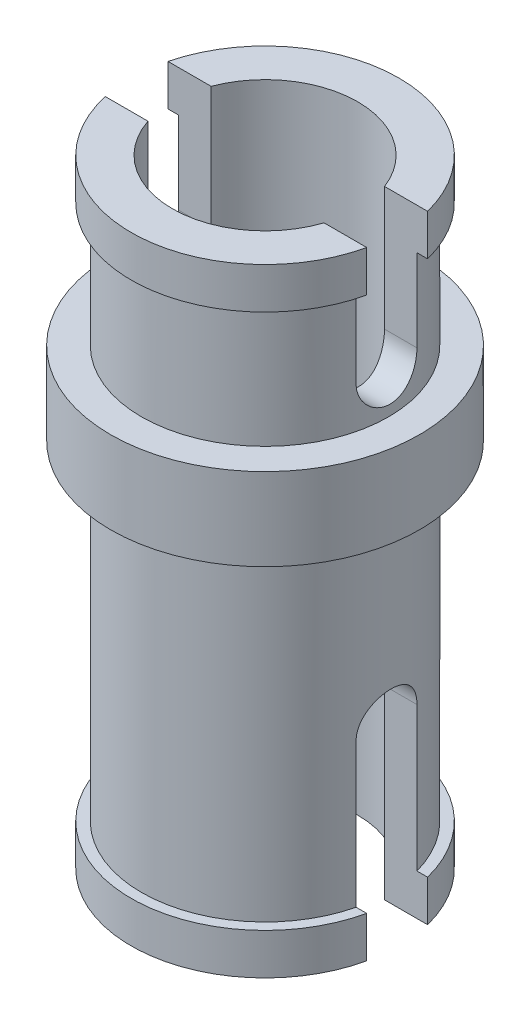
ISO-10303-21;
HEADER;
FILE_DESCRIPTION(('STEP AP214'),'2;1');
FILE_NAME('part.step','',(''),(''),'','','');
FILE_SCHEMA(('AUTOMOTIVE_DESIGN { 1 0 10303 214 1 1 1 1 }'));
ENDSEC;
DATA;
#1=APPLICATION_CONTEXT('core data for automotive mechanical design processes');
#2=APPLICATION_PROTOCOL_DEFINITION('international standard','automotive_design',2000,#1);
#3=PRODUCT_CONTEXT('',#1,'mechanical');
#4=PRODUCT('Part','Part','',(#3));
#5=PRODUCT_RELATED_PRODUCT_CATEGORY('part','',(#4));
#6=PRODUCT_DEFINITION_FORMATION('','',#4);
#7=PRODUCT_DEFINITION_CONTEXT('part definition',#1,'design');
#8=PRODUCT_DEFINITION('design','',#6,#7);
#9=PRODUCT_DEFINITION_SHAPE('','',#8);
#10=(LENGTH_UNIT() NAMED_UNIT(*) SI_UNIT(.MILLI.,.METRE.));
#11=(NAMED_UNIT(*) PLANE_ANGLE_UNIT() SI_UNIT($,.RADIAN.));
#12=(NAMED_UNIT(*) SI_UNIT($,.STERADIAN.) SOLID_ANGLE_UNIT());
#13=UNCERTAINTY_MEASURE_WITH_UNIT(LENGTH_MEASURE(1.E-05),#10,'distance_accuracy_value','');
#14=(GEOMETRIC_REPRESENTATION_CONTEXT(3) GLOBAL_UNCERTAINTY_ASSIGNED_CONTEXT((#13)) GLOBAL_UNIT_ASSIGNED_CONTEXT((#10,
#11,#12)) REPRESENTATION_CONTEXT('',''));
#15=CARTESIAN_POINT('',(0.,0.,0.));
#16=DIRECTION('',(0.,0.,1.));
#17=DIRECTION('',(1.,0.,0.));
#18=AXIS2_PLACEMENT_3D('',#15,#16,#17);
#19=CARTESIAN_POINT('',(0.,3.2,0.));
#20=DIRECTION('',(0.,1.,0.));
#21=DIRECTION('',(0.,0.,1.));
#22=AXIS2_PLACEMENT_3D('',#19,#20,#21);
#23=CYLINDRICAL_SURFACE('',#22,2.6);
#24=DIRECTION('',(0.,1.,0.));
#25=VECTOR('',#24,1.);
#26=CARTESIAN_POINT('',(2.53809081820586,3.2,0.563999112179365));
#27=LINE('',#26,#25);
#28=CARTESIAN_POINT('',(2.53809081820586,4.,0.563999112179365));
#29=VERTEX_POINT('',#28);
#30=CARTESIAN_POINT('',(2.53809081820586,3.2,0.563999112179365));
#31=VERTEX_POINT('',#30);
#32=EDGE_CURVE('E489',#29,#31,#27,.F.);
#33=ORIENTED_EDGE('',*,*,#32,.F.);
#34=CARTESIAN_POINT('',(0.,4.,0.));
#35=DIRECTION('',(0.,1.,0.));
#36=DIRECTION('',(0.,0.,1.));
#37=AXIS2_PLACEMENT_3D('',#34,#35,#36);
#38=CIRCLE('',#37,2.6);
#39=CARTESIAN_POINT('',(-2.53809081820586,4.,0.563999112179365));
#40=VERTEX_POINT('',#39);
#41=EDGE_CURVE('E349',#40,#29,#38,.T.);
#42=ORIENTED_EDGE('',*,*,#41,.F.);
#43=DIRECTION('',(0.,1.,0.));
#44=VECTOR('',#43,1.);
#45=CARTESIAN_POINT('',(-2.53809081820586,3.2,0.563999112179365));
#46=LINE('',#45,#44);
#47=CARTESIAN_POINT('',(-2.53809081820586,3.2,0.563999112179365));
#48=VERTEX_POINT('',#47);
#49=EDGE_CURVE('E505',#48,#40,#46,.T.);
#50=ORIENTED_EDGE('',*,*,#49,.F.);
#51=CARTESIAN_POINT('',(0.,3.2,0.));
#52=DIRECTION('',(0.,1.,0.));
#53=DIRECTION('',(0.,0.,1.));
#54=AXIS2_PLACEMENT_3D('',#51,#52,#53);
#55=CIRCLE('',#54,2.6);
#56=EDGE_CURVE('E348',#48,#31,#55,.T.);
#57=ORIENTED_EDGE('',*,*,#56,.T.);
#58=EDGE_LOOP('',(#33,#42,#50,#57));
#59=FACE_BOUND('',#58,.T.);
#60=ADVANCED_FACE('F36',(#59),#23,.T.);
#61=CARTESIAN_POINT('',(0.,3.2,0.));
#62=DIRECTION('',(0.,1.,0.));
#63=DIRECTION('',(0.,0.,1.));
#64=AXIS2_PLACEMENT_3D('',#61,#62,#63);
#65=PLANE('',#64);
#66=ORIENTED_EDGE('',*,*,#56,.F.);
#67=DIRECTION('',(1.,0.,0.));
#68=VECTOR('',#67,1.);
#69=CARTESIAN_POINT('',(0.,3.2,0.563999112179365));
#70=LINE('',#69,#68);
#71=CARTESIAN_POINT('',(-2.33278910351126,3.2,0.563999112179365));
#72=VERTEX_POINT('',#71);
#73=EDGE_CURVE('E230',#48,#72,#70,.T.);
#74=ORIENTED_EDGE('',*,*,#73,.T.);
#75=CARTESIAN_POINT('',(0.,3.2,0.));
#76=DIRECTION('',(0.,1.,0.));
#77=DIRECTION('',(0.,0.,1.));
#78=AXIS2_PLACEMENT_3D('',#75,#76,#77);
#79=CIRCLE('',#78,2.4);
#80=CARTESIAN_POINT('',(2.33278910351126,3.2,0.563999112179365));
#81=VERTEX_POINT('',#80);
#82=EDGE_CURVE('E477',#72,#81,#79,.T.);
#83=ORIENTED_EDGE('',*,*,#82,.T.);
#84=EDGE_CURVE('E500',#81,#31,#70,.T.);
#85=ORIENTED_EDGE('',*,*,#84,.T.);
#86=EDGE_LOOP('',(#66,#74,#83,#85));
#87=FACE_BOUND('',#86,.T.);
#88=ADVANCED_FACE('F312',(#87),#65,.F.);
#89=CARTESIAN_POINT('',(0.,4.,0.));
#90=DIRECTION('',(0.,1.,0.));
#91=DIRECTION('',(0.,0.,1.));
#92=AXIS2_PLACEMENT_3D('',#89,#90,#91);
#93=PLANE('',#92);
#94=DIRECTION('',(1.,0.,0.));
#95=VECTOR('',#94,1.);
#96=CARTESIAN_POINT('',(0.,4.,0.563999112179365));
#97=LINE('',#96,#95);
#98=CARTESIAN_POINT('',(-1.70935806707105,4.,0.563999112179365));
#99=VERTEX_POINT('',#98);
#100=EDGE_CURVE('E266',#40,#99,#97,.T.);
#101=ORIENTED_EDGE('',*,*,#100,.F.);
#102=ORIENTED_EDGE('',*,*,#41,.T.);
#103=CARTESIAN_POINT('',(1.70935806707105,4.,0.563999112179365));
#104=VERTEX_POINT('',#103);
#105=EDGE_CURVE('E267',#104,#29,#97,.T.);
#106=ORIENTED_EDGE('',*,*,#105,.F.);
#107=CARTESIAN_POINT('',(0.,4.,0.));
#108=DIRECTION('',(0.,1.,0.));
#109=DIRECTION('',(0.,0.,1.));
#110=AXIS2_PLACEMENT_3D('',#107,#108,#109);
#111=CIRCLE('',#110,1.8);
#112=EDGE_CURVE('E228',#99,#104,#111,.T.);
#113=ORIENTED_EDGE('',*,*,#112,.F.);
#114=EDGE_LOOP('',(#101,#102,#106,#113));
#115=FACE_BOUND('',#114,.T.);
#116=ADVANCED_FACE('F318',(#115),#93,.T.);
#117=CARTESIAN_POINT('',(0.,4.,0.));
#118=DIRECTION('',(0.,-1.,0.));
#119=DIRECTION('',(0.,0.,-1.));
#120=AXIS2_PLACEMENT_3D('',#117,#118,#119);
#121=CYLINDRICAL_SURFACE('',#120,2.4);
#122=CARTESIAN_POINT('',(0.,0.8,0.));
#123=DIRECTION('',(0.,1.,0.));
#124=DIRECTION('',(0.,0.,1.));
#125=AXIS2_PLACEMENT_3D('',#122,#123,#124);
#126=CIRCLE('',#125,2.4);
#127=CARTESIAN_POINT('',(0.,0.8,2.4));
#128=VERTEX_POINT('',#127);
#129=EDGE_CURVE('E356',#128,#128,#126,.T.);
#130=ORIENTED_EDGE('',*,*,#129,.T.);
#131=EDGE_LOOP('',(#130));
#132=FACE_BOUND('',#131,.T.);
#133=CARTESIAN_POINT('',(2.31419594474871,1.6,-0.636000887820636));
#134=CARTESIAN_POINT('',(2.31416705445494,1.56688854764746,-0.636032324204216));
#135=CARTESIAN_POINT('',(2.31494846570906,1.53379907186,-0.633262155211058));
#136=CARTESIAN_POINT('',(2.31791197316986,1.46864897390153,-0.622366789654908));
#137=CARTESIAN_POINT('',(2.32009102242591,1.43658627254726,-0.614253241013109));
#138=CARTESIAN_POINT('',(2.32563122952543,1.37432752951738,-0.59291897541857));
#139=CARTESIAN_POINT('',(2.32899220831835,1.34413120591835,-0.579699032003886));
#140=CARTESIAN_POINT('',(2.3365233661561,1.28637395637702,-0.548558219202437));
#141=CARTESIAN_POINT('',(2.34069379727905,1.25881385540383,-0.530635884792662));
#142=CARTESIAN_POINT('',(2.34951148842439,1.20645048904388,-0.490135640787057));
#143=CARTESIAN_POINT('',(2.35416719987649,1.18172093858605,-0.46746425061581));
#144=CARTESIAN_POINT('',(2.36339577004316,1.13636577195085,-0.418312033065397));
#145=CARTESIAN_POINT('',(2.36796861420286,1.11574087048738,-0.391830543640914));
#146=CARTESIAN_POINT('',(2.37664547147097,1.07883383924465,-0.335243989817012));
#147=CARTESIAN_POINT('',(2.38073987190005,1.06263408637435,-0.305083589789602));
#148=CARTESIAN_POINT('',(2.38794093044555,1.03556525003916,-0.242349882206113));
#149=CARTESIAN_POINT('',(2.39104777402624,1.0246951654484,-0.209777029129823));
#150=CARTESIAN_POINT('',(2.39591106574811,1.00881058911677,-0.143812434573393));
#151=CARTESIAN_POINT('',(2.39769273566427,1.00368573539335,-0.110449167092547));
#152=CARTESIAN_POINT('',(2.39984451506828,0.999101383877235,-0.0432919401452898));
#153=CARTESIAN_POINT('',(2.40021482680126,0.999641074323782,-0.00949804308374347));
#154=CARTESIAN_POINT('',(2.39955343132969,1.0062910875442,0.0566712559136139));
#155=CARTESIAN_POINT('',(2.39855627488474,1.01226289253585,0.0890610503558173));
#156=CARTESIAN_POINT('',(2.39536789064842,1.02939472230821,0.152374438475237));
#157=CARTESIAN_POINT('',(2.39317663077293,1.04055488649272,0.183297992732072));
#158=CARTESIAN_POINT('',(2.38785428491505,1.06780338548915,0.243015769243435));
#159=CARTESIAN_POINT('',(2.384717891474,1.08391956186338,0.271796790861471));
#160=CARTESIAN_POINT('',(2.37787482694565,1.12060156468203,0.326292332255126));
#161=CARTESIAN_POINT('',(2.37416807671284,1.14116800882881,0.352006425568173));
#162=CARTESIAN_POINT('',(2.36650518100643,1.18678891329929,0.400334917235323));
#163=CARTESIAN_POINT('',(2.36254507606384,1.21194503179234,0.422852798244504));
#164=CARTESIAN_POINT('',(2.35493151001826,1.26571161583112,0.463383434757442));
#165=CARTESIAN_POINT('',(2.35127813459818,1.29432304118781,0.481394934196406));
#166=CARTESIAN_POINT('',(2.34469483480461,1.35444857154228,0.51250541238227));
#167=CARTESIAN_POINT('',(2.34177041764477,1.3859824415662,0.525567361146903));
#168=CARTESIAN_POINT('',(2.337053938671,1.45086419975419,0.546161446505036));
#169=CARTESIAN_POINT('',(2.3352602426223,1.48420939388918,0.553701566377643));
#170=CARTESIAN_POINT('',(2.33369548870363,1.53153564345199,0.560239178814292));
#171=CARTESIAN_POINT('',(2.33335616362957,1.54519974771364,0.561649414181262));
#172=CARTESIAN_POINT('',(2.33290305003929,1.57257374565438,0.563528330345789));
#173=CARTESIAN_POINT('',(2.332788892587,1.58628352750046,0.563998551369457));
#174=CARTESIAN_POINT('',(2.33278910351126,1.6,0.563999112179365));
#175=B_SPLINE_CURVE_WITH_KNOTS('',3,(#133,#134,#135,#136,#137,#138,#139,#140,#141,#142,#143,
#144,#145,#146,#147,#148,#149,#150,#151,#152,#153,#154,#155,#156,#157,#158,#159,#160,#161,#162,
#163,#164,#165,#166,#167,#168,#169,#170,#171,#172,#173,#174),.UNSPECIFIED.,.F.,.F.,(4,2,2,2,2,2,
2,2,2,2,2,2,2,2,2,2,2,2,2,2,4),(0.,0.0991756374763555,0.198135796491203,0.297080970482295,
0.396057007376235,0.497203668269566,0.59836792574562,0.70130379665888,0.804220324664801,
0.905124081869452,1.00601337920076,1.10440000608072,1.20278927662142,1.30174169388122,
1.40070785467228,1.50221456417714,1.60374953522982,1.70602980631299,1.80816191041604,
1.84935705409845,1.89048464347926),.UNSPECIFIED.);
#176=CARTESIAN_POINT('',(2.3141959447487,1.6,-0.636000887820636));
#177=VERTEX_POINT('',#176);
#178=CARTESIAN_POINT('',(2.33278910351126,1.6,0.563999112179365));
#179=VERTEX_POINT('',#178);
#180=EDGE_CURVE('E226',#177,#179,#175,.T.);
#181=ORIENTED_EDGE('',*,*,#180,.T.);
#182=DIRECTION('',(0.,-1.,0.));
#183=VECTOR('',#182,1.);
#184=CARTESIAN_POINT('',(2.33278910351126,4.,0.563999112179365));
#185=LINE('',#184,#183);
#186=EDGE_CURVE('E503',#179,#81,#185,.F.);
#187=ORIENTED_EDGE('',*,*,#186,.T.);
#188=ORIENTED_EDGE('',*,*,#82,.F.);
#189=DIRECTION('',(0.,-1.,0.));
#190=VECTOR('',#189,1.);
#191=CARTESIAN_POINT('',(-2.33278910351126,4.,0.563999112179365));
#192=LINE('',#191,#190);
#193=CARTESIAN_POINT('',(-2.33278910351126,1.6,0.563999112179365));
#194=VERTEX_POINT('',#193);
#195=EDGE_CURVE('E225',#72,#194,#192,.T.);
#196=ORIENTED_EDGE('',*,*,#195,.T.);
#197=CARTESIAN_POINT('',(-2.33278910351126,1.6,0.563999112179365));
#198=CARTESIAN_POINT('',(-2.33276139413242,1.56672987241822,0.56402987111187));
#199=CARTESIAN_POINT('',(-2.33345744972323,1.53347938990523,0.561233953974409));
#200=CARTESIAN_POINT('',(-2.33608745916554,1.4679988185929,0.550229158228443));
#201=CARTESIAN_POINT('',(-2.33801906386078,1.43576691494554,0.542030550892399));
#202=CARTESIAN_POINT('',(-2.34291191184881,1.37317273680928,0.520459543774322));
#203=CARTESIAN_POINT('',(-2.34587311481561,1.34281038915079,0.507087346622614));
#204=CARTESIAN_POINT('',(-2.35246488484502,1.28474815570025,0.475572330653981));
#205=CARTESIAN_POINT('',(-2.35609560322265,1.25704887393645,0.457428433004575));
#206=CARTESIAN_POINT('',(-2.36367594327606,1.20456762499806,0.416503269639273));
#207=CARTESIAN_POINT('',(-2.36763004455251,1.17984541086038,0.393646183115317));
#208=CARTESIAN_POINT('',(-2.37533585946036,1.13454589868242,0.344103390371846));
#209=CARTESIAN_POINT('',(-2.379087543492,1.11396920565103,0.317417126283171));
#210=CARTESIAN_POINT('',(-2.38598095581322,1.07734115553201,0.260615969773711));
#211=CARTESIAN_POINT('',(-2.38911577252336,1.0613402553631,0.230467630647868));
#212=CARTESIAN_POINT('',(-2.39433139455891,1.03465445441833,0.167820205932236));
#213=CARTESIAN_POINT('',(-2.3964124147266,1.0239684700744,0.135321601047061));
#214=CARTESIAN_POINT('',(-2.39921078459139,1.00842450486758,0.0696140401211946));
#215=CARTESIAN_POINT('',(-2.39995547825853,1.00345043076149,0.0364337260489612));
#216=CARTESIAN_POINT('',(-2.40004059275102,0.99909659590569,-0.0302921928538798));
#217=CARTESIAN_POINT('',(-2.3993811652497,0.999716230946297,-0.0638377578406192));
#218=CARTESIAN_POINT('',(-2.39671750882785,1.0064490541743,-0.129650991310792));
#219=CARTESIAN_POINT('',(-2.39473976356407,1.0124548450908,-0.161930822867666));
#220=CARTESIAN_POINT('',(-2.38963964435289,1.02960683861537,-0.224997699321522));
#221=CARTESIAN_POINT('',(-2.38651720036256,1.04075335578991,-0.255784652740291));
#222=CARTESIAN_POINT('',(-2.379374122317,1.06801247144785,-0.315424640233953));
#223=CARTESIAN_POINT('',(-2.37534288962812,1.08418459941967,-0.344249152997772));
#224=CARTESIAN_POINT('',(-2.36679352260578,1.12099020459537,-0.398813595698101));
#225=CARTESIAN_POINT('',(-2.36227530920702,1.1416244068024,-0.424553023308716));
#226=CARTESIAN_POINT('',(-2.35306501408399,1.18745743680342,-0.472980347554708));
#227=CARTESIAN_POINT('',(-2.34837161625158,1.21276832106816,-0.495562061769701));
#228=CARTESIAN_POINT('',(-2.33943193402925,1.26688952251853,-0.536183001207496));
#229=CARTESIAN_POINT('',(-2.33518576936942,1.29570077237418,-0.554221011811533));
#230=CARTESIAN_POINT('',(-2.32759951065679,1.35614535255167,-0.58526722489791));
#231=CARTESIAN_POINT('',(-2.32426236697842,1.38778743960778,-0.598259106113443));
#232=CARTESIAN_POINT('',(-2.31890963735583,1.45289885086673,-0.618685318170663));
#233=CARTESIAN_POINT('',(-2.31689200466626,1.48636525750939,-0.626128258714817));
#234=CARTESIAN_POINT('',(-2.31517011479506,1.53343496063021,-0.632447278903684));
#235=CARTESIAN_POINT('',(-2.31480532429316,1.5467212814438,-0.633780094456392));
#236=CARTESIAN_POINT('',(-2.31431836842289,1.5733362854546,-0.635555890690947));
#237=CARTESIAN_POINT('',(-2.31419581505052,1.5866648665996,-0.636000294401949));
#238=CARTESIAN_POINT('',(-2.31419594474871,1.6,-0.636000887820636));
#239=B_SPLINE_CURVE_WITH_KNOTS('',3,(#197,#198,#199,#200,#201,#202,#203,#204,#205,#206,#207,
#208,#209,#210,#211,#212,#213,#214,#215,#216,#217,#218,#219,#220,#221,#222,#223,#224,#225,#226,
#227,#228,#229,#230,#231,#232,#233,#234,#235,#236,#237,#238),.UNSPECIFIED.,.F.,.F.,(4,2,2,2,2,2,
2,2,2,2,2,2,2,2,2,2,2,2,2,2,4),(0.,0.0996557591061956,0.199122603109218,0.298585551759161,
0.398071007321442,0.499303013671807,0.600549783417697,0.702873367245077,0.805176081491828,
0.905360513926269,1.00553412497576,1.10375367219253,1.20197923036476,1.30141574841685,
1.40086843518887,1.50311818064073,1.60539523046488,1.70800038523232,1.81044600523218,
1.85049461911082,1.89047903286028),.UNSPECIFIED.);
#240=CARTESIAN_POINT('',(-2.31419594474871,1.6,-0.636000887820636));
#241=VERTEX_POINT('',#240);
#242=EDGE_CURVE('E216',#194,#241,#239,.T.);
#243=ORIENTED_EDGE('',*,*,#242,.T.);
#244=DIRECTION('',(0.,-1.,0.));
#245=VECTOR('',#244,1.);
#246=CARTESIAN_POINT('',(-2.31419594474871,4.,-0.636000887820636));
#247=LINE('',#246,#245);
#248=CARTESIAN_POINT('',(-2.31419594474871,3.2,-0.636000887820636));
#249=VERTEX_POINT('',#248);
#250=EDGE_CURVE('E202',#241,#249,#247,.F.);
#251=ORIENTED_EDGE('',*,*,#250,.T.);
#252=CARTESIAN_POINT('',(2.31419594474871,3.2,-0.636000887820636));
#253=VERTEX_POINT('',#252);
#254=EDGE_CURVE('E482',#253,#249,#79,.T.);
#255=ORIENTED_EDGE('',*,*,#254,.F.);
#256=DIRECTION('',(0.,-1.,0.));
#257=VECTOR('',#256,1.);
#258=CARTESIAN_POINT('',(2.31419594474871,4.,-0.636000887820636));
#259=LINE('',#258,#257);
#260=EDGE_CURVE('E486',#253,#177,#259,.T.);
#261=ORIENTED_EDGE('',*,*,#260,.T.);
#262=EDGE_LOOP('',(#181,#187,#188,#196,#243,#251,#255,#261));
#263=FACE_BOUND('',#262,.T.);
#264=ADVANCED_FACE('F223',(#132,#263),#121,.T.);
#265=CARTESIAN_POINT('',(0.,-8.,0.));
#266=DIRECTION('',(0.,1.,0.));
#267=DIRECTION('',(0.,0.,1.));
#268=AXIS2_PLACEMENT_3D('',#265,#266,#267);
#269=CYLINDRICAL_SURFACE('',#268,2.4);
#270=CARTESIAN_POINT('',(0.,-0.8,0.));
#271=DIRECTION('',(0.,1.,0.));
#272=DIRECTION('',(0.,0.,1.));
#273=AXIS2_PLACEMENT_3D('',#270,#271,#272);
#274=CIRCLE('',#273,2.4);
#275=CARTESIAN_POINT('',(0.,-0.8,2.4));
#276=VERTEX_POINT('',#275);
#277=EDGE_CURVE('E474',#276,#276,#274,.F.);
#278=ORIENTED_EDGE('',*,*,#277,.T.);
#279=EDGE_LOOP('',(#278));
#280=FACE_BOUND('',#279,.T.);
#281=CARTESIAN_POINT('',(2.31419594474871,-4.4,-0.636000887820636));
#282=CARTESIAN_POINT('',(2.31416705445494,-4.36688854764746,-0.636032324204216));
#283=CARTESIAN_POINT('',(2.31494846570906,-4.33379907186,-0.633262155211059));
#284=CARTESIAN_POINT('',(2.31791197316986,-4.26864897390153,-0.622366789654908));
#285=CARTESIAN_POINT('',(2.32009102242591,-4.23658627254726,-0.614253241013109));
#286=CARTESIAN_POINT('',(2.32563122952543,-4.17432752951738,-0.59291897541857));
#287=CARTESIAN_POINT('',(2.32899220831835,-4.14413120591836,-0.579699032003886));
#288=CARTESIAN_POINT('',(2.3365233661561,-4.08637395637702,-0.548558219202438));
#289=CARTESIAN_POINT('',(2.34069379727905,-4.05881385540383,-0.530635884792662));
#290=CARTESIAN_POINT('',(2.34951148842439,-4.00645048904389,-0.490135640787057));
#291=CARTESIAN_POINT('',(2.35416719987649,-3.98172093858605,-0.467464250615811));
#292=CARTESIAN_POINT('',(2.36339577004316,-3.93636577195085,-0.418312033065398));
#293=CARTESIAN_POINT('',(2.36796861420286,-3.91574087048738,-0.391830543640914));
#294=CARTESIAN_POINT('',(2.37664547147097,-3.87883383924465,-0.335243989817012));
#295=CARTESIAN_POINT('',(2.38073987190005,-3.86263408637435,-0.305083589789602));
#296=CARTESIAN_POINT('',(2.38794093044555,-3.83556525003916,-0.242349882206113));
#297=CARTESIAN_POINT('',(2.39104777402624,-3.8246951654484,-0.209777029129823));
#298=CARTESIAN_POINT('',(2.39591106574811,-3.80881058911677,-0.143812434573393));
#299=CARTESIAN_POINT('',(2.39769273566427,-3.80368573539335,-0.110449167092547));
#300=CARTESIAN_POINT('',(2.39984451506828,-3.79910138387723,-0.0432919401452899));
#301=CARTESIAN_POINT('',(2.40021482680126,-3.79964107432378,-0.00949804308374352));
#302=CARTESIAN_POINT('',(2.39955343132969,-3.8062910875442,0.0566712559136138));
#303=CARTESIAN_POINT('',(2.39855627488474,-3.81226289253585,0.0890610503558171));
#304=CARTESIAN_POINT('',(2.39536789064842,-3.82939472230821,0.152374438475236));
#305=CARTESIAN_POINT('',(2.39317663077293,-3.84055488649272,0.183297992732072));
#306=CARTESIAN_POINT('',(2.38785428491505,-3.86780338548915,0.243015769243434));
#307=CARTESIAN_POINT('',(2.384717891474,-3.88391956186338,0.271796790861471));
#308=CARTESIAN_POINT('',(2.37787482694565,-3.92060156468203,0.326292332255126));
#309=CARTESIAN_POINT('',(2.37416807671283,-3.94116800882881,0.352006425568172));
#310=CARTESIAN_POINT('',(2.36650518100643,-3.98678891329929,0.400334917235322));
#311=CARTESIAN_POINT('',(2.36254507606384,-4.01194503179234,0.422852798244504));
#312=CARTESIAN_POINT('',(2.35493151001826,-4.06571161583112,0.463383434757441));
#313=CARTESIAN_POINT('',(2.35127813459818,-4.09432304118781,0.481394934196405));
#314=CARTESIAN_POINT('',(2.34469483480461,-4.15444857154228,0.51250541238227));
#315=CARTESIAN_POINT('',(2.34177041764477,-4.1859824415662,0.525567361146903));
#316=CARTESIAN_POINT('',(2.337053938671,-4.25086419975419,0.546161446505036));
#317=CARTESIAN_POINT('',(2.3352602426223,-4.28420939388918,0.553701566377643));
#318=CARTESIAN_POINT('',(2.33369548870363,-4.33153564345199,0.560239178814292));
#319=CARTESIAN_POINT('',(2.33335616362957,-4.34519974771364,0.561649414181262));
#320=CARTESIAN_POINT('',(2.33290305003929,-4.37257374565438,0.563528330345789));
#321=CARTESIAN_POINT('',(2.332788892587,-4.38628352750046,0.563998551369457));
#322=CARTESIAN_POINT('',(2.33278910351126,-4.4,0.563999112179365));
#323=B_SPLINE_CURVE_WITH_KNOTS('',3,(#281,#282,#283,#284,#285,#286,#287,#288,#289,#290,#291,
#292,#293,#294,#295,#296,#297,#298,#299,#300,#301,#302,#303,#304,#305,#306,#307,#308,#309,#310,
#311,#312,#313,#314,#315,#316,#317,#318,#319,#320,#321,#322),.UNSPECIFIED.,.F.,.F.,(4,2,2,2,2,2,
2,2,2,2,2,2,2,2,2,2,2,2,2,2,4),(0.,0.0991756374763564,0.198135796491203,0.297080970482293,
0.396057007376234,0.497203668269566,0.59836792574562,0.701303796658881,0.804220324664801,
0.905124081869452,1.00601337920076,1.10440000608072,1.20278927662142,1.30174169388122,
1.40070785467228,1.50221456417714,1.60374953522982,1.70602980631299,1.80816191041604,
1.84935705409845,1.89048464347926),.UNSPECIFIED.);
#324=CARTESIAN_POINT('',(2.31419594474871,-4.4,-0.636000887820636));
#325=VERTEX_POINT('',#324);
#326=CARTESIAN_POINT('',(2.33278910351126,-4.4,0.563999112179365));
#327=VERTEX_POINT('',#326);
#328=EDGE_CURVE('E425',#325,#327,#323,.T.);
#329=ORIENTED_EDGE('',*,*,#328,.F.);
#330=DIRECTION('',(0.,1.,0.));
#331=VECTOR('',#330,1.);
#332=CARTESIAN_POINT('',(2.31419594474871,-8.,-0.636000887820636));
#333=LINE('',#332,#331);
#334=CARTESIAN_POINT('',(2.31419594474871,-7.2,-0.636000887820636));
#335=VERTEX_POINT('',#334);
#336=EDGE_CURVE('E432',#335,#325,#333,.T.);
#337=ORIENTED_EDGE('',*,*,#336,.F.);
#338=CARTESIAN_POINT('',(0.,-7.2,0.));
#339=DIRECTION('',(0.,-1.,0.));
#340=DIRECTION('',(0.,0.,-1.));
#341=AXIS2_PLACEMENT_3D('',#338,#339,#340);
#342=CIRCLE('',#341,2.4);
#343=CARTESIAN_POINT('',(-2.31419594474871,-7.2,-0.636000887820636));
#344=VERTEX_POINT('',#343);
#345=EDGE_CURVE('E478',#335,#344,#342,.F.);
#346=ORIENTED_EDGE('',*,*,#345,.T.);
#347=DIRECTION('',(0.,1.,0.));
#348=VECTOR('',#347,1.);
#349=CARTESIAN_POINT('',(-2.31419594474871,-8.,-0.636000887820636));
#350=LINE('',#349,#348);
#351=CARTESIAN_POINT('',(-2.31419594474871,-4.4,-0.636000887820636));
#352=VERTEX_POINT('',#351);
#353=EDGE_CURVE('E406',#344,#352,#350,.T.);
#354=ORIENTED_EDGE('',*,*,#353,.T.);
#355=CARTESIAN_POINT('',(-2.31419594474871,-4.4,-0.636000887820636));
#356=CARTESIAN_POINT('',(-2.31416705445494,-4.36688854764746,-0.636032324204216));
#357=CARTESIAN_POINT('',(-2.31494846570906,-4.33379907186,-0.633262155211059));
#358=CARTESIAN_POINT('',(-2.31791197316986,-4.26864897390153,-0.622366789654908));
#359=CARTESIAN_POINT('',(-2.32009102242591,-4.23658627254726,-0.614253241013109));
#360=CARTESIAN_POINT('',(-2.32563122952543,-4.17432752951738,-0.59291897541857));
#361=CARTESIAN_POINT('',(-2.32899220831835,-4.14413120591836,-0.579699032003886));
#362=CARTESIAN_POINT('',(-2.3365233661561,-4.08637395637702,-0.548558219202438));
#363=CARTESIAN_POINT('',(-2.34069379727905,-4.05881385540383,-0.530635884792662));
#364=CARTESIAN_POINT('',(-2.34951148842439,-4.00645048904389,-0.490135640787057));
#365=CARTESIAN_POINT('',(-2.35416719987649,-3.98172093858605,-0.467464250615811));
#366=CARTESIAN_POINT('',(-2.36339577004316,-3.93636577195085,-0.418312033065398));
#367=CARTESIAN_POINT('',(-2.36796861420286,-3.91574087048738,-0.391830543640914));
#368=CARTESIAN_POINT('',(-2.37664547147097,-3.87883383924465,-0.335243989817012));
#369=CARTESIAN_POINT('',(-2.38073987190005,-3.86263408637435,-0.305083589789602));
#370=CARTESIAN_POINT('',(-2.38794093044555,-3.83556525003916,-0.242349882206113));
#371=CARTESIAN_POINT('',(-2.39104777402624,-3.8246951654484,-0.209777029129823));
#372=CARTESIAN_POINT('',(-2.39591106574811,-3.80881058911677,-0.143812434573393));
#373=CARTESIAN_POINT('',(-2.39769273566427,-3.80368573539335,-0.110449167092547));
#374=CARTESIAN_POINT('',(-2.39984451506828,-3.79910138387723,-0.0432919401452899));
#375=CARTESIAN_POINT('',(-2.40021482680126,-3.79964107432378,-0.00949804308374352));
#376=CARTESIAN_POINT('',(-2.39955343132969,-3.8062910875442,0.0566712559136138));
#377=CARTESIAN_POINT('',(-2.39855627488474,-3.81226289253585,0.0890610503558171));
#378=CARTESIAN_POINT('',(-2.39536789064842,-3.82939472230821,0.152374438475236));
#379=CARTESIAN_POINT('',(-2.39317663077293,-3.84055488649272,0.183297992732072));
#380=CARTESIAN_POINT('',(-2.38785428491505,-3.86780338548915,0.243015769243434));
#381=CARTESIAN_POINT('',(-2.384717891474,-3.88391956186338,0.271796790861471));
#382=CARTESIAN_POINT('',(-2.37787482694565,-3.92060156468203,0.326292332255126));
#383=CARTESIAN_POINT('',(-2.37416807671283,-3.94116800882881,0.352006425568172));
#384=CARTESIAN_POINT('',(-2.36650518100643,-3.98678891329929,0.400334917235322));
#385=CARTESIAN_POINT('',(-2.36254507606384,-4.01194503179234,0.422852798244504));
#386=CARTESIAN_POINT('',(-2.35493151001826,-4.06571161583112,0.463383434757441));
#387=CARTESIAN_POINT('',(-2.35127813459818,-4.09432304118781,0.481394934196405));
#388=CARTESIAN_POINT('',(-2.34469483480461,-4.15444857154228,0.51250541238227));
#389=CARTESIAN_POINT('',(-2.34177041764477,-4.1859824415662,0.525567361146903));
#390=CARTESIAN_POINT('',(-2.337053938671,-4.25086419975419,0.546161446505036));
#391=CARTESIAN_POINT('',(-2.3352602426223,-4.28420939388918,0.553701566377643));
#392=CARTESIAN_POINT('',(-2.33369548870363,-4.33153564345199,0.560239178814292));
#393=CARTESIAN_POINT('',(-2.33335616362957,-4.34519974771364,0.561649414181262));
#394=CARTESIAN_POINT('',(-2.33290305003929,-4.37257374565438,0.563528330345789));
#395=CARTESIAN_POINT('',(-2.332788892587,-4.38628352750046,0.563998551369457));
#396=CARTESIAN_POINT('',(-2.33278910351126,-4.4,0.563999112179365));
#397=B_SPLINE_CURVE_WITH_KNOTS('',3,(#355,#356,#357,#358,#359,#360,#361,#362,#363,#364,#365,
#366,#367,#368,#369,#370,#371,#372,#373,#374,#375,#376,#377,#378,#379,#380,#381,#382,#383,#384,
#385,#386,#387,#388,#389,#390,#391,#392,#393,#394,#395,#396),.UNSPECIFIED.,.F.,.F.,(4,2,2,2,2,2,
2,2,2,2,2,2,2,2,2,2,2,2,2,2,4),(0.,0.0991756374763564,0.198135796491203,0.297080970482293,
0.396057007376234,0.497203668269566,0.59836792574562,0.701303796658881,0.804220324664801,
0.905124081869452,1.00601337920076,1.10440000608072,1.20278927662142,1.30174169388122,
1.40070785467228,1.50221456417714,1.60374953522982,1.70602980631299,1.80816191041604,
1.84935705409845,1.89048464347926),.UNSPECIFIED.);
#398=CARTESIAN_POINT('',(-2.33278910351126,-4.4,0.563999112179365));
#399=VERTEX_POINT('',#398);
#400=EDGE_CURVE('E377',#352,#399,#397,.T.);
#401=ORIENTED_EDGE('',*,*,#400,.T.);
#402=DIRECTION('',(0.,1.,0.));
#403=VECTOR('',#402,1.);
#404=CARTESIAN_POINT('',(-2.33278910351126,-8.,0.563999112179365));
#405=LINE('',#404,#403);
#406=CARTESIAN_POINT('',(-2.33278910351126,-7.2,0.563999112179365));
#407=VERTEX_POINT('',#406);
#408=EDGE_CURVE('E385',#399,#407,#405,.F.);
#409=ORIENTED_EDGE('',*,*,#408,.T.);
#410=CARTESIAN_POINT('',(2.33278910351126,-7.2,0.563999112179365));
#411=VERTEX_POINT('',#410);
#412=EDGE_CURVE('E471',#407,#411,#342,.F.);
#413=ORIENTED_EDGE('',*,*,#412,.T.);
#414=DIRECTION('',(0.,1.,0.));
#415=VECTOR('',#414,1.);
#416=CARTESIAN_POINT('',(2.33278910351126,-8.,0.563999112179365));
#417=LINE('',#416,#415);
#418=EDGE_CURVE('E453',#327,#411,#417,.F.);
#419=ORIENTED_EDGE('',*,*,#418,.F.);
#420=EDGE_LOOP('',(#329,#337,#346,#354,#401,#409,#413,#419));
#421=FACE_BOUND('',#420,.T.);
#422=ADVANCED_FACE('F38',(#280,#421),#269,.T.);
#423=CARTESIAN_POINT('',(0.,-7.2,0.));
#424=DIRECTION('',(0.,-1.,0.));
#425=DIRECTION('',(0.,0.,-1.));
#426=AXIS2_PLACEMENT_3D('',#423,#424,#425);
#427=CYLINDRICAL_SURFACE('',#426,2.6);
#428=CARTESIAN_POINT('',(0.,-7.2,0.));
#429=DIRECTION('',(0.,-1.,0.));
#430=DIRECTION('',(0.,0.,-1.));
#431=AXIS2_PLACEMENT_3D('',#428,#429,#430);
#432=CIRCLE('',#431,2.6);
#433=CARTESIAN_POINT('',(-2.52101227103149,-7.2,-0.636000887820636));
#434=VERTEX_POINT('',#433);
#435=CARTESIAN_POINT('',(2.52101227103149,-7.2,-0.636000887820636));
#436=VERTEX_POINT('',#435);
#437=EDGE_CURVE('E459',#434,#436,#432,.T.);
#438=ORIENTED_EDGE('',*,*,#437,.T.);
#439=DIRECTION('',(0.,-1.,0.));
#440=VECTOR('',#439,1.);
#441=CARTESIAN_POINT('',(2.52101227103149,-7.2,-0.636000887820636));
#442=LINE('',#441,#440);
#443=CARTESIAN_POINT('',(2.52101227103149,-8.,-0.636000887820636));
#444=VERTEX_POINT('',#443);
#445=EDGE_CURVE('E433',#444,#436,#442,.F.);
#446=ORIENTED_EDGE('',*,*,#445,.F.);
#447=CARTESIAN_POINT('',(0.,-8.,0.));
#448=DIRECTION('',(0.,-1.,0.));
#449=DIRECTION('',(0.,0.,-1.));
#450=AXIS2_PLACEMENT_3D('',#447,#448,#449);
#451=CIRCLE('',#450,2.6);
#452=CARTESIAN_POINT('',(-2.52101227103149,-8.,-0.636000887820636));
#453=VERTEX_POINT('',#452);
#454=EDGE_CURVE('E464',#453,#444,#451,.T.);
#455=ORIENTED_EDGE('',*,*,#454,.F.);
#456=DIRECTION('',(0.,-1.,0.));
#457=VECTOR('',#456,1.);
#458=CARTESIAN_POINT('',(-2.52101227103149,-7.2,-0.636000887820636));
#459=LINE('',#458,#457);
#460=EDGE_CURVE('E403',#453,#434,#459,.F.);
#461=ORIENTED_EDGE('',*,*,#460,.T.);
#462=EDGE_LOOP('',(#438,#446,#455,#461));
#463=FACE_BOUND('',#462,.T.);
#464=ADVANCED_FACE('F286',(#463),#427,.T.);
#465=CARTESIAN_POINT('',(2.53809081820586,-8.,0.563999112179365));
#466=VERTEX_POINT('',#465);
#467=CARTESIAN_POINT('',(-2.53809081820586,-8.,0.563999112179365));
#468=VERTEX_POINT('',#467);
#469=EDGE_CURVE('E463',#466,#468,#451,.T.);
#470=ORIENTED_EDGE('',*,*,#469,.F.);
#471=DIRECTION('',(0.,-1.,0.));
#472=VECTOR('',#471,1.);
#473=CARTESIAN_POINT('',(2.53809081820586,-7.2,0.563999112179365));
#474=LINE('',#473,#472);
#475=CARTESIAN_POINT('',(2.53809081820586,-7.2,0.563999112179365));
#476=VERTEX_POINT('',#475);
#477=EDGE_CURVE('E451',#476,#466,#474,.T.);
#478=ORIENTED_EDGE('',*,*,#477,.F.);
#479=CARTESIAN_POINT('',(-2.53809081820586,-7.2,0.563999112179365));
#480=VERTEX_POINT('',#479);
#481=EDGE_CURVE('E462',#476,#480,#432,.T.);
#482=ORIENTED_EDGE('',*,*,#481,.T.);
#483=DIRECTION('',(0.,-1.,0.));
#484=VECTOR('',#483,1.);
#485=CARTESIAN_POINT('',(-2.53809081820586,-7.2,0.563999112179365));
#486=LINE('',#485,#484);
#487=EDGE_CURVE('E386',#480,#468,#486,.T.);
#488=ORIENTED_EDGE('',*,*,#487,.T.);
#489=EDGE_LOOP('',(#470,#478,#482,#488));
#490=FACE_BOUND('',#489,.T.);
#491=ADVANCED_FACE('F284',(#490),#427,.T.);
#492=CARTESIAN_POINT('',(0.,-7.2,0.));
#493=DIRECTION('',(0.,-1.,0.));
#494=DIRECTION('',(0.,0.,-1.));
#495=AXIS2_PLACEMENT_3D('',#492,#493,#494);
#496=PLANE('',#495);
#497=DIRECTION('',(1.,0.,0.));
#498=VECTOR('',#497,1.);
#499=CARTESIAN_POINT('',(3.001,-7.2,-0.636000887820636));
#500=LINE('',#499,#498);
#501=EDGE_CURVE('E775',#335,#436,#500,.T.);
#502=ORIENTED_EDGE('',*,*,#501,.T.);
#503=ORIENTED_EDGE('',*,*,#437,.F.);
#504=DIRECTION('',(-1.,0.,0.));
#505=VECTOR('',#504,1.);
#506=CARTESIAN_POINT('',(-3.001,-7.2,-0.636000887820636));
#507=LINE('',#506,#505);
#508=EDGE_CURVE('E401',#344,#434,#507,.T.);
#509=ORIENTED_EDGE('',*,*,#508,.F.);
#510=ORIENTED_EDGE('',*,*,#345,.F.);
#511=EDGE_LOOP('',(#502,#503,#509,#510));
#512=FACE_BOUND('',#511,.T.);
#513=ADVANCED_FACE('F279',(#512),#496,.F.);
#514=DIRECTION('',(-1.,0.,0.));
#515=VECTOR('',#514,1.);
#516=CARTESIAN_POINT('',(3.001,-7.2,0.563999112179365));
#517=LINE('',#516,#515);
#518=EDGE_CURVE('E448',#476,#411,#517,.T.);
#519=ORIENTED_EDGE('',*,*,#518,.T.);
#520=ORIENTED_EDGE('',*,*,#412,.F.);
#521=DIRECTION('',(1.,0.,0.));
#522=VECTOR('',#521,1.);
#523=CARTESIAN_POINT('',(-3.001,-7.2,0.563999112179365));
#524=LINE('',#523,#522);
#525=EDGE_CURVE('E762',#480,#407,#524,.T.);
#526=ORIENTED_EDGE('',*,*,#525,.F.);
#527=ORIENTED_EDGE('',*,*,#481,.F.);
#528=EDGE_LOOP('',(#519,#520,#526,#527));
#529=FACE_BOUND('',#528,.T.);
#530=ADVANCED_FACE('F283',(#529),#496,.F.);
#531=CARTESIAN_POINT('',(0.,-8.,0.));
#532=DIRECTION('',(0.,1.,0.));
#533=DIRECTION('',(0.,0.,1.));
#534=AXIS2_PLACEMENT_3D('',#531,#532,#533);
#535=PLANE('',#534);
#536=DIRECTION('',(-1.,0.,0.));
#537=VECTOR('',#536,1.);
#538=CARTESIAN_POINT('',(3.001,-8.,-0.636000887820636));
#539=LINE('',#538,#537);
#540=CARTESIAN_POINT('',(1.68389514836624,-8.,-0.636000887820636));
#541=VERTEX_POINT('',#540);
#542=EDGE_CURVE('E443',#444,#541,#539,.T.);
#543=ORIENTED_EDGE('',*,*,#542,.T.);
#544=CARTESIAN_POINT('',(0.,-8.,0.));
#545=DIRECTION('',(0.,1.,0.));
#546=DIRECTION('',(0.,0.,1.));
#547=AXIS2_PLACEMENT_3D('',#544,#545,#546);
#548=CIRCLE('',#547,1.8);
#549=CARTESIAN_POINT('',(-1.68389514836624,-8.,-0.636000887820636));
#550=VERTEX_POINT('',#549);
#551=EDGE_CURVE('E458',#550,#541,#548,.F.);
#552=ORIENTED_EDGE('',*,*,#551,.F.);
#553=DIRECTION('',(1.,0.,0.));
#554=VECTOR('',#553,1.);
#555=CARTESIAN_POINT('',(-3.001,-8.,-0.636000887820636));
#556=LINE('',#555,#554);
#557=EDGE_CURVE('E389',#453,#550,#556,.T.);
#558=ORIENTED_EDGE('',*,*,#557,.F.);
#559=ORIENTED_EDGE('',*,*,#454,.T.);
#560=EDGE_LOOP('',(#543,#552,#558,#559));
#561=FACE_BOUND('',#560,.T.);
#562=ADVANCED_FACE('F301',(#561),#535,.F.);
#563=DIRECTION('',(-1.,0.,0.));
#564=VECTOR('',#563,1.);
#565=CARTESIAN_POINT('',(3.001,-8.,0.563999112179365));
#566=LINE('',#565,#564);
#567=CARTESIAN_POINT('',(1.70935806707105,-8.,0.563999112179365));
#568=VERTEX_POINT('',#567);
#569=EDGE_CURVE('E435',#466,#568,#566,.T.);
#570=ORIENTED_EDGE('',*,*,#569,.F.);
#571=ORIENTED_EDGE('',*,*,#469,.T.);
#572=DIRECTION('',(1.,0.,0.));
#573=VECTOR('',#572,1.);
#574=CARTESIAN_POINT('',(-3.001,-8.,0.563999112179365));
#575=LINE('',#574,#573);
#576=CARTESIAN_POINT('',(-1.70935806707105,-8.,0.563999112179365));
#577=VERTEX_POINT('',#576);
#578=EDGE_CURVE('E390',#468,#577,#575,.T.);
#579=ORIENTED_EDGE('',*,*,#578,.T.);
#580=EDGE_CURVE('E455',#568,#577,#548,.F.);
#581=ORIENTED_EDGE('',*,*,#580,.F.);
#582=EDGE_LOOP('',(#570,#571,#579,#581));
#583=FACE_BOUND('',#582,.T.);
#584=ADVANCED_FACE('F275',(#583),#535,.F.);
#585=CARTESIAN_POINT('',(0.,-8.001,0.));
#586=DIRECTION('',(0.,1.,0.));
#587=DIRECTION('',(0.,0.,1.));
#588=AXIS2_PLACEMENT_3D('',#585,#586,#587);
#589=CYLINDRICAL_SURFACE('',#588,1.8);
#590=DIRECTION('',(0.,1.,0.));
#591=VECTOR('',#590,1.);
#592=CARTESIAN_POINT('',(1.68389514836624,-8.001,-0.636000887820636));
#593=LINE('',#592,#591);
#594=CARTESIAN_POINT('',(1.68389514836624,-4.4,-0.636000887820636));
#595=VERTEX_POINT('',#594);
#596=EDGE_CURVE('E417',#541,#595,#593,.T.);
#597=ORIENTED_EDGE('',*,*,#596,.T.);
#598=CARTESIAN_POINT('',(1.68389514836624,-4.4,-0.636000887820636));
#599=CARTESIAN_POINT('',(1.68385552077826,-4.36739781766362,-0.636034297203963));
#600=CARTESIAN_POINT('',(1.68489783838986,-4.33482871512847,-0.633346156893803));
#601=CARTESIAN_POINT('',(1.68883756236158,-4.27075833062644,-0.622802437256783));
#602=CARTESIAN_POINT('',(1.69172887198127,-4.23925389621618,-0.614963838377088));
#603=CARTESIAN_POINT('',(1.69905907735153,-4.17810905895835,-0.594398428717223));
#604=CARTESIAN_POINT('',(1.70349695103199,-4.14846744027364,-0.58167484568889));
#605=CARTESIAN_POINT('',(1.71342556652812,-4.09171855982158,-0.551744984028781));
#606=CARTESIAN_POINT('',(1.71891703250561,-4.06461306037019,-0.534535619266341));
#607=CARTESIAN_POINT('',(1.73063042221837,-4.0125461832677,-0.495329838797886));
#608=CARTESIAN_POINT('',(1.73687258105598,-3.98771107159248,-0.473171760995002));
#609=CARTESIAN_POINT('',(1.74927182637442,-3.94202156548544,-0.425047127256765));
#610=CARTESIAN_POINT('',(1.75542889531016,-3.92116798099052,-0.399079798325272));
#611=CARTESIAN_POINT('',(1.76724978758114,-3.88336804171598,-0.343035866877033));
#612=CARTESIAN_POINT('',(1.77289079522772,-3.8665723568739,-0.312852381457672));
#613=CARTESIAN_POINT('',(1.78285715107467,-3.83835082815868,-0.249870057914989));
#614=CARTESIAN_POINT('',(1.78718287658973,-3.82692344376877,-0.21707197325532));
#615=CARTESIAN_POINT('',(1.79395741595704,-3.81015903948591,-0.150943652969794));
#616=CARTESIAN_POINT('',(1.79646413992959,-3.80463119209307,-0.117667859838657));
#617=CARTESIAN_POINT('',(1.79960232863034,-3.79923441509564,-0.0505758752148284));
#618=CARTESIAN_POINT('',(1.80023430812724,-3.79936393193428,-0.0167598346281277));
#619=CARTESIAN_POINT('',(1.79962272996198,-3.80516046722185,0.0488743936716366));
#620=CARTESIAN_POINT('',(1.79846017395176,-3.81058449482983,0.0807151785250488));
#621=CARTESIAN_POINT('',(1.79458032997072,-3.82642954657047,0.14302560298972));
#622=CARTESIAN_POINT('',(1.79186299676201,-3.83685071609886,0.17349520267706));
#623=CARTESIAN_POINT('',(1.78517289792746,-3.86244953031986,0.232478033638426));
#624=CARTESIAN_POINT('',(1.78119111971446,-3.87766131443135,0.260975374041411));
#625=CARTESIAN_POINT('',(1.77242050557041,-3.91237990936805,0.315084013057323));
#626=CARTESIAN_POINT('',(1.76763146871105,-3.93188778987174,0.340694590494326));
#627=CARTESIAN_POINT('',(1.75753681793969,-3.97565671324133,0.389503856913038));
#628=CARTESIAN_POINT('',(1.75221771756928,-4.00009005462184,0.412545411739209));
#629=CARTESIAN_POINT('',(1.74186738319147,-4.05249981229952,0.454270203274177));
#630=CARTESIAN_POINT('',(1.73683624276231,-4.08047737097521,0.472952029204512));
#631=CARTESIAN_POINT('',(1.72758322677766,-4.13979332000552,0.505719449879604));
#632=CARTESIAN_POINT('',(1.72337718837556,-4.17118228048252,0.51971817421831));
#633=CARTESIAN_POINT('',(1.71644727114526,-4.23601710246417,0.542170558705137));
#634=CARTESIAN_POINT('',(1.71372120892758,-4.26945985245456,0.550632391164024));
#635=CARTESIAN_POINT('',(1.71107460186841,-4.31935320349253,0.558775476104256));
#636=CARTESIAN_POINT('',(1.71043284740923,-4.33542364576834,0.560733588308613));
#637=CARTESIAN_POINT('',(1.70957421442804,-4.36765989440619,0.563344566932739));
#638=CARTESIAN_POINT('',(1.70935677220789,-4.38382554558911,0.56399916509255));
#639=CARTESIAN_POINT('',(1.70935806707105,-4.4,0.563999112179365));
#640=B_SPLINE_CURVE_WITH_KNOTS('',3,(#598,#599,#600,#601,#602,#603,#604,#605,#606,#607,#608,
#609,#610,#611,#612,#613,#614,#615,#616,#617,#618,#619,#620,#621,#622,#623,#624,#625,#626,#627,
#628,#629,#630,#631,#632,#633,#634,#635,#636,#637,#638,#639),.UNSPECIFIED.,.F.,.F.,(4,2,2,2,2,2,
2,2,2,2,2,2,2,2,2,2,2,2,2,2,4),(0.,0.0976276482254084,0.194935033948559,0.292178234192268,
0.389488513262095,0.490626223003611,0.591784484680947,0.696262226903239,0.800709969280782,
0.901666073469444,1.00259445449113,1.09909853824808,1.19560543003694,1.29281624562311,
1.39005129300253,1.49159441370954,1.593170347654,1.69653768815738,1.7997521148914,
1.84830806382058,1.89679946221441),.UNSPECIFIED.);
#641=CARTESIAN_POINT('',(1.70935806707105,-4.4,0.563999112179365));
#642=VERTEX_POINT('',#641);
#643=EDGE_CURVE('E409',#595,#642,#640,.T.);
#644=ORIENTED_EDGE('',*,*,#643,.T.);
#645=DIRECTION('',(0.,1.,0.));
#646=VECTOR('',#645,1.);
#647=CARTESIAN_POINT('',(1.70935806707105,-8.001,0.563999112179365));
#648=LINE('',#647,#646);
#649=EDGE_CURVE('E445',#642,#568,#648,.F.);
#650=ORIENTED_EDGE('',*,*,#649,.T.);
#651=ORIENTED_EDGE('',*,*,#580,.T.);
#652=DIRECTION('',(0.,1.,0.));
#653=VECTOR('',#652,1.);
#654=CARTESIAN_POINT('',(-1.70935806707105,-8.001,0.563999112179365));
#655=LINE('',#654,#653);
#656=CARTESIAN_POINT('',(-1.70935806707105,-4.4,0.563999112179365));
#657=VERTEX_POINT('',#656);
#658=EDGE_CURVE('E367',#657,#577,#655,.F.);
#659=ORIENTED_EDGE('',*,*,#658,.F.);
#660=CARTESIAN_POINT('',(-1.68389514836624,-4.4,-0.636000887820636));
#661=CARTESIAN_POINT('',(-1.68385552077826,-4.36739781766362,-0.636034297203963));
#662=CARTESIAN_POINT('',(-1.68489783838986,-4.33482871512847,-0.633346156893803));
#663=CARTESIAN_POINT('',(-1.68883756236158,-4.27075833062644,-0.622802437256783));
#664=CARTESIAN_POINT('',(-1.69172887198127,-4.23925389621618,-0.614963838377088));
#665=CARTESIAN_POINT('',(-1.69905907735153,-4.17810905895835,-0.594398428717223));
#666=CARTESIAN_POINT('',(-1.70349695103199,-4.14846744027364,-0.58167484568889));
#667=CARTESIAN_POINT('',(-1.71342556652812,-4.09171855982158,-0.551744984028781));
#668=CARTESIAN_POINT('',(-1.71891703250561,-4.06461306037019,-0.534535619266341));
#669=CARTESIAN_POINT('',(-1.73063042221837,-4.0125461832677,-0.495329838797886));
#670=CARTESIAN_POINT('',(-1.73687258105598,-3.98771107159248,-0.473171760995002));
#671=CARTESIAN_POINT('',(-1.74927182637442,-3.94202156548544,-0.425047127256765));
#672=CARTESIAN_POINT('',(-1.75542889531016,-3.92116798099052,-0.399079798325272));
#673=CARTESIAN_POINT('',(-1.76724978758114,-3.88336804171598,-0.343035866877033));
#674=CARTESIAN_POINT('',(-1.77289079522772,-3.8665723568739,-0.312852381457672));
#675=CARTESIAN_POINT('',(-1.78285715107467,-3.83835082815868,-0.249870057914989));
#676=CARTESIAN_POINT('',(-1.78718287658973,-3.82692344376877,-0.21707197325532));
#677=CARTESIAN_POINT('',(-1.79395741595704,-3.81015903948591,-0.150943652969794));
#678=CARTESIAN_POINT('',(-1.79646413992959,-3.80463119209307,-0.117667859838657));
#679=CARTESIAN_POINT('',(-1.79960232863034,-3.79923441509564,-0.0505758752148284));
#680=CARTESIAN_POINT('',(-1.80023430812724,-3.79936393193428,-0.0167598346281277));
#681=CARTESIAN_POINT('',(-1.79962272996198,-3.80516046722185,0.0488743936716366));
#682=CARTESIAN_POINT('',(-1.79846017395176,-3.81058449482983,0.0807151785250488));
#683=CARTESIAN_POINT('',(-1.79458032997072,-3.82642954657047,0.14302560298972));
#684=CARTESIAN_POINT('',(-1.79186299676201,-3.83685071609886,0.17349520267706));
#685=CARTESIAN_POINT('',(-1.78517289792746,-3.86244953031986,0.232478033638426));
#686=CARTESIAN_POINT('',(-1.78119111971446,-3.87766131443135,0.260975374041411));
#687=CARTESIAN_POINT('',(-1.77242050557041,-3.91237990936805,0.315084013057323));
#688=CARTESIAN_POINT('',(-1.76763146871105,-3.93188778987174,0.340694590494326));
#689=CARTESIAN_POINT('',(-1.75753681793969,-3.97565671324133,0.389503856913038));
#690=CARTESIAN_POINT('',(-1.75221771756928,-4.00009005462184,0.412545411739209));
#691=CARTESIAN_POINT('',(-1.74186738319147,-4.05249981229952,0.454270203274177));
#692=CARTESIAN_POINT('',(-1.73683624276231,-4.08047737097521,0.472952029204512));
#693=CARTESIAN_POINT('',(-1.72758322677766,-4.13979332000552,0.505719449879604));
#694=CARTESIAN_POINT('',(-1.72337718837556,-4.17118228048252,0.51971817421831));
#695=CARTESIAN_POINT('',(-1.71644727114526,-4.23601710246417,0.542170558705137));
#696=CARTESIAN_POINT('',(-1.71372120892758,-4.26945985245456,0.550632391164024));
#697=CARTESIAN_POINT('',(-1.71107460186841,-4.31935320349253,0.558775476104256));
#698=CARTESIAN_POINT('',(-1.71043284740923,-4.33542364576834,0.560733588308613));
#699=CARTESIAN_POINT('',(-1.70957421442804,-4.36765989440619,0.563344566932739));
#700=CARTESIAN_POINT('',(-1.70935677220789,-4.38382554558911,0.56399916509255));
#701=CARTESIAN_POINT('',(-1.70935806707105,-4.4,0.563999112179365));
#702=B_SPLINE_CURVE_WITH_KNOTS('',3,(#660,#661,#662,#663,#664,#665,#666,#667,#668,#669,#670,
#671,#672,#673,#674,#675,#676,#677,#678,#679,#680,#681,#682,#683,#684,#685,#686,#687,#688,#689,
#690,#691,#692,#693,#694,#695,#696,#697,#698,#699,#700,#701),.UNSPECIFIED.,.F.,.F.,(4,2,2,2,2,2,
2,2,2,2,2,2,2,2,2,2,2,2,2,2,4),(0.,0.0976276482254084,0.194935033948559,0.292178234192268,
0.389488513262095,0.490626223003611,0.591784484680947,0.696262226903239,0.800709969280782,
0.901666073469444,1.00259445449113,1.09909853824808,1.19560543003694,1.29281624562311,
1.39005129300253,1.49159441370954,1.593170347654,1.69653768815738,1.7997521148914,
1.84830806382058,1.89679946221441),.UNSPECIFIED.);
#703=CARTESIAN_POINT('',(-1.68389514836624,-4.4,-0.636000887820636));
#704=VERTEX_POINT('',#703);
#705=EDGE_CURVE('E359',#704,#657,#702,.T.);
#706=ORIENTED_EDGE('',*,*,#705,.F.);
#707=DIRECTION('',(0.,1.,0.));
#708=VECTOR('',#707,1.);
#709=CARTESIAN_POINT('',(-1.68389514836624,-8.001,-0.636000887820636));
#710=LINE('',#709,#708);
#711=EDGE_CURVE('E393',#550,#704,#710,.T.);
#712=ORIENTED_EDGE('',*,*,#711,.F.);
#713=ORIENTED_EDGE('',*,*,#551,.T.);
#714=EDGE_LOOP('',(#597,#644,#650,#651,#659,#706,#712,#713));
#715=FACE_BOUND('',#714,.T.);
#716=CARTESIAN_POINT('',(-1.68389514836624,1.6,-0.636000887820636));
#717=CARTESIAN_POINT('',(-1.68385552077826,1.56739781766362,-0.636034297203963));
#718=CARTESIAN_POINT('',(-1.68489783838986,1.53482871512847,-0.633346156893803));
#719=CARTESIAN_POINT('',(-1.68883756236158,1.47075833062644,-0.622802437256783));
#720=CARTESIAN_POINT('',(-1.69172887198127,1.43925389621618,-0.614963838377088));
#721=CARTESIAN_POINT('',(-1.69905907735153,1.37810905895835,-0.594398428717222));
#722=CARTESIAN_POINT('',(-1.70349695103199,1.34846744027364,-0.58167484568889));
#723=CARTESIAN_POINT('',(-1.71342556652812,1.29171855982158,-0.551744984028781));
#724=CARTESIAN_POINT('',(-1.71891703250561,1.26461306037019,-0.53453561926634));
#725=CARTESIAN_POINT('',(-1.73063042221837,1.2125461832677,-0.495329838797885));
#726=CARTESIAN_POINT('',(-1.73687258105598,1.18771107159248,-0.473171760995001));
#727=CARTESIAN_POINT('',(-1.74927182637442,1.14202156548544,-0.425047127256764));
#728=CARTESIAN_POINT('',(-1.75542889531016,1.12116798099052,-0.399079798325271));
#729=CARTESIAN_POINT('',(-1.76724978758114,1.08336804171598,-0.343035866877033));
#730=CARTESIAN_POINT('',(-1.77289079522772,1.0665723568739,-0.312852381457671));
#731=CARTESIAN_POINT('',(-1.78285715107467,1.03835082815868,-0.249870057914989));
#732=CARTESIAN_POINT('',(-1.78718287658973,1.02692344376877,-0.21707197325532));
#733=CARTESIAN_POINT('',(-1.79395741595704,1.01015903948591,-0.150943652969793));
#734=CARTESIAN_POINT('',(-1.79646413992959,1.00463119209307,-0.117667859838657));
#735=CARTESIAN_POINT('',(-1.79960232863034,0.999234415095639,-0.0505758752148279));
#736=CARTESIAN_POINT('',(-1.80023430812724,0.99936393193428,-0.0167598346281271));
#737=CARTESIAN_POINT('',(-1.79962272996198,1.00516046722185,0.0488743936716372));
#738=CARTESIAN_POINT('',(-1.79846017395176,1.01058449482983,0.0807151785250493));
#739=CARTESIAN_POINT('',(-1.79458032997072,1.02642954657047,0.14302560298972));
#740=CARTESIAN_POINT('',(-1.79186299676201,1.03685071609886,0.173495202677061));
#741=CARTESIAN_POINT('',(-1.78517289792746,1.06244953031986,0.232478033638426));
#742=CARTESIAN_POINT('',(-1.78119111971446,1.07766131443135,0.260975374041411));
#743=CARTESIAN_POINT('',(-1.77242050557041,1.11237990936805,0.315084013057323));
#744=CARTESIAN_POINT('',(-1.76763146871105,1.13188778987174,0.340694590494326));
#745=CARTESIAN_POINT('',(-1.75753681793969,1.17565671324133,0.389503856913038));
#746=CARTESIAN_POINT('',(-1.75221771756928,1.20009005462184,0.41254541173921));
#747=CARTESIAN_POINT('',(-1.74186738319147,1.25249981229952,0.454270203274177));
#748=CARTESIAN_POINT('',(-1.73683624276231,1.28047737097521,0.472952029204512));
#749=CARTESIAN_POINT('',(-1.72758322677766,1.33979332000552,0.505719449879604));
#750=CARTESIAN_POINT('',(-1.72337718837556,1.37118228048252,0.51971817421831));
#751=CARTESIAN_POINT('',(-1.71644727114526,1.43601710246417,0.542170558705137));
#752=CARTESIAN_POINT('',(-1.71372120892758,1.46945985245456,0.550632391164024));
#753=CARTESIAN_POINT('',(-1.71107460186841,1.51935320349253,0.558775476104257));
#754=CARTESIAN_POINT('',(-1.71043284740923,1.53542364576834,0.560733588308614));
#755=CARTESIAN_POINT('',(-1.70957421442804,1.56765989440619,0.563344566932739));
#756=CARTESIAN_POINT('',(-1.70935677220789,1.58382554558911,0.56399916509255));
#757=CARTESIAN_POINT('',(-1.70935806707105,1.6,0.563999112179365));
#758=B_SPLINE_CURVE_WITH_KNOTS('',3,(#716,#717,#718,#719,#720,#721,#722,#723,#724,#725,#726,
#727,#728,#729,#730,#731,#732,#733,#734,#735,#736,#737,#738,#739,#740,#741,#742,#743,#744,#745,
#746,#747,#748,#749,#750,#751,#752,#753,#754,#755,#756,#757),.UNSPECIFIED.,.F.,.F.,(4,2,2,2,2,2,
2,2,2,2,2,2,2,2,2,2,2,2,2,2,4),(0.,0.0976276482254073,0.194935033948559,0.292178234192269,
0.389488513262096,0.490626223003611,0.591784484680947,0.696262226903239,0.800709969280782,
0.901666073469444,1.00259445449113,1.09909853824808,1.19560543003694,1.29281624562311,
1.39005129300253,1.49159441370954,1.593170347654,1.69653768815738,1.7997521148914,
1.84830806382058,1.89679946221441),.UNSPECIFIED.);
#759=CARTESIAN_POINT('',(-1.68389514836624,1.6,-0.636000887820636));
#760=VERTEX_POINT('',#759);
#761=CARTESIAN_POINT('',(-1.70935806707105,1.6,0.563999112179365));
#762=VERTEX_POINT('',#761);
#763=EDGE_CURVE('E11',#760,#762,#758,.T.);
#764=ORIENTED_EDGE('',*,*,#763,.T.);
#765=DIRECTION('',(0.,1.,0.));
#766=VECTOR('',#765,1.);
#767=CARTESIAN_POINT('',(-1.70935806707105,-8.001,0.563999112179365));
#768=LINE('',#767,#766);
#769=EDGE_CURVE('E506',#762,#99,#768,.T.);
#770=ORIENTED_EDGE('',*,*,#769,.T.);
#771=ORIENTED_EDGE('',*,*,#112,.T.);
#772=DIRECTION('',(0.,1.,0.));
#773=VECTOR('',#772,1.);
#774=CARTESIAN_POINT('',(1.70935806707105,-8.001,0.563999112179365));
#775=LINE('',#774,#773);
#776=CARTESIAN_POINT('',(1.70935806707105,1.6,0.563999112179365));
#777=VERTEX_POINT('',#776);
#778=EDGE_CURVE('E491',#104,#777,#775,.F.);
#779=ORIENTED_EDGE('',*,*,#778,.T.);
#780=CARTESIAN_POINT('',(1.70935806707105,1.6,0.563999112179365));
#781=CARTESIAN_POINT('',(1.70932037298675,1.56711164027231,0.564031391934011));
#782=CARTESIAN_POINT('',(1.71024942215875,1.53425199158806,0.56129737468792));
#783=CARTESIAN_POINT('',(1.71375044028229,1.46958551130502,0.550559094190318));
#784=CARTESIAN_POINT('',(1.71631781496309,1.4377759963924,0.542569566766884));
#785=CARTESIAN_POINT('',(1.72280644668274,1.37602531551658,0.521584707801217));
#786=CARTESIAN_POINT('',(1.72672709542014,1.34608331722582,0.50859162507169));
#787=CARTESIAN_POINT('',(1.73544511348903,1.28878005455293,0.478000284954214));
#788=CARTESIAN_POINT('',(1.7402429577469,1.26142020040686,0.460399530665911));
#789=CARTESIAN_POINT('',(1.75033491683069,1.2091229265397,0.420433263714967));
#790=CARTESIAN_POINT('',(1.7556398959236,1.18428879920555,0.397935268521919));
#791=CARTESIAN_POINT('',(1.76600042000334,1.13867545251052,0.349091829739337));
#792=CARTESIAN_POINT('',(1.7710559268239,1.11789685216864,0.32274579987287));
#793=CARTESIAN_POINT('',(1.78042720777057,1.08059201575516,0.26629393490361));
#794=CARTESIAN_POINT('',(1.78472624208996,1.06415872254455,0.23612366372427));
#795=CARTESIAN_POINT('',(1.79191844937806,1.03663830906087,0.173281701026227));
#796=CARTESIAN_POINT('',(1.79481207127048,1.02554948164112,0.140610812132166));
#797=CARTESIAN_POINT('',(1.79872916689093,1.00941226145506,0.0749415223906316));
#798=CARTESIAN_POINT('',(1.79981571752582,1.00416235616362,0.0419964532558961));
#799=CARTESIAN_POINT('',(1.80014085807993,0.999193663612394,-0.0243144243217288));
#800=CARTESIAN_POINT('',(1.79937982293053,0.999473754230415,-0.0576801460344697));
#801=CARTESIAN_POINT('',(1.79610015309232,1.00542682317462,-0.122666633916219));
#802=CARTESIAN_POINT('',(1.79364305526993,1.01091343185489,-0.154307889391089));
#803=CARTESIAN_POINT('',(1.7872430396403,1.0267994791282,-0.216171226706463));
#804=CARTESIAN_POINT('',(1.78330000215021,1.03719931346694,-0.246393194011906));
#805=CARTESIAN_POINT('',(1.77418914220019,1.06281055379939,-0.305214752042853));
#806=CARTESIAN_POINT('',(1.76899957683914,1.07810919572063,-0.333772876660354));
#807=CARTESIAN_POINT('',(1.75790903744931,1.11301324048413,-0.3879719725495));
#808=CARTESIAN_POINT('',(1.75200785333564,1.13261991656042,-0.41361207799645));
#809=CARTESIAN_POINT('',(1.7397352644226,1.1767269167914,-0.462590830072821));
#810=CARTESIAN_POINT('',(1.73335504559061,1.20142150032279,-0.485752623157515));
#811=CARTESIAN_POINT('',(1.72106282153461,1.25443268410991,-0.5276560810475));
#812=CARTESIAN_POINT('',(1.71515096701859,1.2827504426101,-0.546396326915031));
#813=CARTESIAN_POINT('',(1.70439148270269,1.34265311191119,-0.579094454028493));
#814=CARTESIAN_POINT('',(1.69955692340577,1.37427195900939,-0.592994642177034));
#815=CARTESIAN_POINT('',(1.69165142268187,1.43960313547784,-0.615188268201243));
#816=CARTESIAN_POINT('',(1.68857749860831,1.47331181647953,-0.623491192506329));
#817=CARTESIAN_POINT('',(1.68569640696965,1.52279572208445,-0.631215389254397));
#818=CARTESIAN_POINT('',(1.68502273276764,1.53818322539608,-0.633009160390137));
#819=CARTESIAN_POINT('',(1.68412187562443,1.569044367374,-0.63540110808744));
#820=CARTESIAN_POINT('',(1.68389413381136,1.58451787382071,-0.636000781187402));
#821=CARTESIAN_POINT('',(1.68389514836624,1.6,-0.636000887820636));
#822=B_SPLINE_CURVE_WITH_KNOTS('',3,(#780,#781,#782,#783,#784,#785,#786,#787,#788,#789,#790,
#791,#792,#793,#794,#795,#796,#797,#798,#799,#800,#801,#802,#803,#804,#805,#806,#807,#808,#809,
#810,#811,#812,#813,#814,#815,#816,#817,#818,#819,#820,#821),.UNSPECIFIED.,.F.,.F.,(4,2,2,2,2,2,
2,2,2,2,2,2,2,2,2,2,2,2,2,2,4),(0.,0.0984939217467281,0.196712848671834,0.294887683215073,
0.393115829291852,0.494434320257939,0.595768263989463,0.69912059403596,0.802439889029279,
0.902070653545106,1.00168120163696,1.09785552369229,1.1940375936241,1.29203776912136,
1.39006694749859,1.49295073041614,1.59586748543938,1.69997207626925,1.80389978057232,
1.85037424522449,1.89679042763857),.UNSPECIFIED.);
#823=CARTESIAN_POINT('',(1.68389514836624,1.6,-0.636000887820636));
#824=VERTEX_POINT('',#823);
#825=EDGE_CURVE('E50',#777,#824,#822,.T.);
#826=ORIENTED_EDGE('',*,*,#825,.T.);
#827=DIRECTION('',(0.,1.,0.));
#828=VECTOR('',#827,1.);
#829=CARTESIAN_POINT('',(1.68389514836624,-8.001,-0.636000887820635));
#830=LINE('',#829,#828);
#831=CARTESIAN_POINT('',(1.68389514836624,4.,-0.636000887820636));
#832=VERTEX_POINT('',#831);
#833=EDGE_CURVE('E493',#824,#832,#830,.T.);
#834=ORIENTED_EDGE('',*,*,#833,.T.);
#835=CARTESIAN_POINT('',(-1.68389514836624,4.,-0.636000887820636));
#836=VERTEX_POINT('',#835);
#837=EDGE_CURVE('E354',#832,#836,#111,.T.);
#838=ORIENTED_EDGE('',*,*,#837,.T.);
#839=DIRECTION('',(0.,1.,0.));
#840=VECTOR('',#839,1.);
#841=CARTESIAN_POINT('',(-1.68389514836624,-8.001,-0.636000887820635));
#842=LINE('',#841,#840);
#843=EDGE_CURVE('E65',#836,#760,#842,.F.);
#844=ORIENTED_EDGE('',*,*,#843,.T.);
#845=EDGE_LOOP('',(#764,#770,#771,#779,#826,#834,#838,#844));
#846=FACE_BOUND('',#845,.T.);
#847=ADVANCED_FACE('F269',(#715,#846),#589,.F.);
#848=CARTESIAN_POINT('',(0.,-0.8,0.));
#849=DIRECTION('',(0.,1.,0.));
#850=DIRECTION('',(0.,0.,1.));
#851=AXIS2_PLACEMENT_3D('',#848,#849,#850);
#852=CYLINDRICAL_SURFACE('',#851,3.);
#853=CARTESIAN_POINT('',(0.,-0.8,0.));
#854=DIRECTION('',(0.,1.,0.));
#855=DIRECTION('',(0.,0.,1.));
#856=AXIS2_PLACEMENT_3D('',#853,#854,#855);
#857=CIRCLE('',#856,3.);
#858=CARTESIAN_POINT('',(0.,-0.8,3.));
#859=VERTEX_POINT('',#858);
#860=EDGE_CURVE('E470',#859,#859,#857,.T.);
#861=ORIENTED_EDGE('',*,*,#860,.T.);
#862=EDGE_LOOP('',(#861));
#863=FACE_BOUND('',#862,.T.);
#864=CARTESIAN_POINT('',(0.,0.8,0.));
#865=DIRECTION('',(0.,1.,0.));
#866=DIRECTION('',(0.,0.,1.));
#867=AXIS2_PLACEMENT_3D('',#864,#865,#866);
#868=CIRCLE('',#867,3.);
#869=CARTESIAN_POINT('',(0.,0.8,3.));
#870=VERTEX_POINT('',#869);
#871=EDGE_CURVE('E467',#870,#870,#868,.T.);
#872=ORIENTED_EDGE('',*,*,#871,.F.);
#873=EDGE_LOOP('',(#872));
#874=FACE_BOUND('',#873,.T.);
#875=ADVANCED_FACE('F274',(#863,#874),#852,.T.);
#876=CARTESIAN_POINT('',(0.,-0.8,0.));
#877=DIRECTION('',(0.,1.,0.));
#878=DIRECTION('',(0.,0.,1.));
#879=AXIS2_PLACEMENT_3D('',#876,#877,#878);
#880=PLANE('',#879);
#881=ORIENTED_EDGE('',*,*,#277,.F.);
#882=EDGE_LOOP('',(#881));
#883=FACE_BOUND('',#882,.T.);
#884=ORIENTED_EDGE('',*,*,#860,.F.);
#885=EDGE_LOOP('',(#884));
#886=FACE_BOUND('',#885,.T.);
#887=ADVANCED_FACE('F294',(#883,#886),#880,.F.);
#888=CARTESIAN_POINT('',(0.,0.8,0.));
#889=DIRECTION('',(0.,1.,0.));
#890=DIRECTION('',(0.,0.,1.));
#891=AXIS2_PLACEMENT_3D('',#888,#889,#890);
#892=PLANE('',#891);
#893=ORIENTED_EDGE('',*,*,#129,.F.);
#894=EDGE_LOOP('',(#893));
#895=FACE_BOUND('',#894,.T.);
#896=ORIENTED_EDGE('',*,*,#871,.T.);
#897=EDGE_LOOP('',(#896));
#898=FACE_BOUND('',#897,.T.);
#899=ADVANCED_FACE('F290',(#895,#898),#892,.T.);
#900=CARTESIAN_POINT('',(-3.001,-8.,0.563999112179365));
#901=DIRECTION('',(0.,0.,1.));
#902=DIRECTION('',(1.,0.,0.));
#903=AXIS2_PLACEMENT_3D('',#900,#901,#902);
#904=PLANE('',#903);
#905=DIRECTION('',(1.,0.,0.));
#906=VECTOR('',#905,1.);
#907=CARTESIAN_POINT('',(-3.001,-4.4,0.563999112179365));
#908=LINE('',#907,#906);
#909=EDGE_CURVE('E394',#399,#657,#908,.T.);
#910=ORIENTED_EDGE('',*,*,#909,.T.);
#911=ORIENTED_EDGE('',*,*,#658,.T.);
#912=ORIENTED_EDGE('',*,*,#578,.F.);
#913=ORIENTED_EDGE('',*,*,#487,.F.);
#914=ORIENTED_EDGE('',*,*,#525,.T.);
#915=ORIENTED_EDGE('',*,*,#408,.F.);
#916=EDGE_LOOP('',(#910,#911,#912,#913,#914,#915));
#917=FACE_BOUND('',#916,.T.);
#918=ADVANCED_FACE('F293',(#917),#904,.F.);
#919=CARTESIAN_POINT('',(-3.001,-4.4,-0.0360008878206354));
#920=DIRECTION('',(1.,0.,0.));
#921=DIRECTION('',(0.,0.,-1.));
#922=AXIS2_PLACEMENT_3D('',#919,#920,#921);
#923=CYLINDRICAL_SURFACE('',#922,0.600000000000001);
#924=DIRECTION('',(1.,0.,0.));
#925=VECTOR('',#924,1.);
#926=CARTESIAN_POINT('',(-3.001,-4.4,-0.636000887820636));
#927=LINE('',#926,#925);
#928=EDGE_CURVE('E396',#352,#704,#927,.T.);
#929=ORIENTED_EDGE('',*,*,#928,.T.);
#930=ORIENTED_EDGE('',*,*,#705,.T.);
#931=ORIENTED_EDGE('',*,*,#909,.F.);
#932=ORIENTED_EDGE('',*,*,#400,.F.);
#933=EDGE_LOOP('',(#929,#930,#931,#932));
#934=FACE_BOUND('',#933,.T.);
#935=ADVANCED_FACE('F369',(#934),#923,.F.);
#936=CARTESIAN_POINT('',(-3.001,-8.,-0.636000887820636));
#937=DIRECTION('',(0.,0.,-1.));
#938=DIRECTION('',(-1.,0.,0.));
#939=AXIS2_PLACEMENT_3D('',#936,#937,#938);
#940=PLANE('',#939);
#941=ORIENTED_EDGE('',*,*,#508,.T.);
#942=ORIENTED_EDGE('',*,*,#460,.F.);
#943=ORIENTED_EDGE('',*,*,#557,.T.);
#944=ORIENTED_EDGE('',*,*,#711,.T.);
#945=ORIENTED_EDGE('',*,*,#928,.F.);
#946=ORIENTED_EDGE('',*,*,#353,.F.);
#947=EDGE_LOOP('',(#941,#942,#943,#944,#945,#946));
#948=FACE_BOUND('',#947,.T.);
#949=ADVANCED_FACE('F422',(#948),#940,.F.);
#950=CARTESIAN_POINT('',(3.001,-8.,-0.636000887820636));
#951=DIRECTION('',(0.,0.,1.));
#952=DIRECTION('',(1.,0.,0.));
#953=AXIS2_PLACEMENT_3D('',#950,#951,#952);
#954=PLANE('',#953);
#955=ORIENTED_EDGE('',*,*,#336,.T.);
#956=DIRECTION('',(-1.,0.,0.));
#957=VECTOR('',#956,1.);
#958=CARTESIAN_POINT('',(3.001,-4.4,-0.636000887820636));
#959=LINE('',#958,#957);
#960=EDGE_CURVE('E440',#325,#595,#959,.T.);
#961=ORIENTED_EDGE('',*,*,#960,.T.);
#962=ORIENTED_EDGE('',*,*,#596,.F.);
#963=ORIENTED_EDGE('',*,*,#542,.F.);
#964=ORIENTED_EDGE('',*,*,#445,.T.);
#965=ORIENTED_EDGE('',*,*,#501,.F.);
#966=EDGE_LOOP('',(#955,#961,#962,#963,#964,#965));
#967=FACE_BOUND('',#966,.T.);
#968=ADVANCED_FACE('F277',(#967),#954,.T.);
#969=CARTESIAN_POINT('',(3.001,-4.4,-0.0360008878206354));
#970=DIRECTION('',(-1.,0.,0.));
#971=DIRECTION('',(0.,0.,1.));
#972=AXIS2_PLACEMENT_3D('',#969,#970,#971);
#973=CYLINDRICAL_SURFACE('',#972,0.600000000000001);
#974=ORIENTED_EDGE('',*,*,#328,.T.);
#975=DIRECTION('',(-1.,0.,0.));
#976=VECTOR('',#975,1.);
#977=CARTESIAN_POINT('',(3.001,-4.4,0.563999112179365));
#978=LINE('',#977,#976);
#979=EDGE_CURVE('E437',#327,#642,#978,.T.);
#980=ORIENTED_EDGE('',*,*,#979,.T.);
#981=ORIENTED_EDGE('',*,*,#643,.F.);
#982=ORIENTED_EDGE('',*,*,#960,.F.);
#983=EDGE_LOOP('',(#974,#980,#981,#982));
#984=FACE_BOUND('',#983,.T.);
#985=ADVANCED_FACE('F330',(#984),#973,.F.);
#986=CARTESIAN_POINT('',(3.001,-8.,0.563999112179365));
#987=DIRECTION('',(0.,0.,-1.));
#988=DIRECTION('',(-1.,0.,0.));
#989=AXIS2_PLACEMENT_3D('',#986,#987,#988);
#990=PLANE('',#989);
#991=ORIENTED_EDGE('',*,*,#418,.T.);
#992=ORIENTED_EDGE('',*,*,#518,.F.);
#993=ORIENTED_EDGE('',*,*,#477,.T.);
#994=ORIENTED_EDGE('',*,*,#569,.T.);
#995=ORIENTED_EDGE('',*,*,#649,.F.);
#996=ORIENTED_EDGE('',*,*,#979,.F.);
#997=EDGE_LOOP('',(#991,#992,#993,#994,#995,#996));
#998=FACE_BOUND('',#997,.T.);
#999=ADVANCED_FACE('F322',(#998),#990,.T.);
#1000=DIRECTION('',(0.,1.,0.));
#1001=VECTOR('',#1000,1.);
#1002=CARTESIAN_POINT('',(-2.52101227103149,3.2,-0.636000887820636));
#1003=LINE('',#1002,#1001);
#1004=CARTESIAN_POINT('',(-2.52101227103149,4.,-0.636000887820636));
#1005=VERTEX_POINT('',#1004);
#1006=CARTESIAN_POINT('',(-2.52101227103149,3.2,-0.636000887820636));
#1007=VERTEX_POINT('',#1006);
#1008=EDGE_CURVE('E336',#1005,#1007,#1003,.F.);
#1009=ORIENTED_EDGE('',*,*,#1008,.F.);
#1010=CARTESIAN_POINT('',(2.52101227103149,4.,-0.636000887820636));
#1011=VERTEX_POINT('',#1010);
#1012=EDGE_CURVE('E338',#1011,#1005,#38,.T.);
#1013=ORIENTED_EDGE('',*,*,#1012,.F.);
#1014=DIRECTION('',(0.,1.,0.));
#1015=VECTOR('',#1014,1.);
#1016=CARTESIAN_POINT('',(2.52101227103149,3.2,-0.636000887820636));
#1017=LINE('',#1016,#1015);
#1018=CARTESIAN_POINT('',(2.52101227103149,3.2,-0.636000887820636));
#1019=VERTEX_POINT('',#1018);
#1020=EDGE_CURVE('E57',#1019,#1011,#1017,.T.);
#1021=ORIENTED_EDGE('',*,*,#1020,.F.);
#1022=EDGE_CURVE('E340',#1019,#1007,#55,.T.);
#1023=ORIENTED_EDGE('',*,*,#1022,.T.);
#1024=EDGE_LOOP('',(#1009,#1013,#1021,#1023));
#1025=FACE_BOUND('',#1024,.T.);
#1026=ADVANCED_FACE('F314',(#1025),#23,.T.);
#1027=ORIENTED_EDGE('',*,*,#1022,.F.);
#1028=DIRECTION('',(-1.,0.,0.));
#1029=VECTOR('',#1028,1.);
#1030=CARTESIAN_POINT('',(0.,3.2,-0.636000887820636));
#1031=LINE('',#1030,#1029);
#1032=EDGE_CURVE('E484',#1019,#253,#1031,.T.);
#1033=ORIENTED_EDGE('',*,*,#1032,.T.);
#1034=ORIENTED_EDGE('',*,*,#254,.T.);
#1035=EDGE_CURVE('E207',#249,#1007,#1031,.T.);
#1036=ORIENTED_EDGE('',*,*,#1035,.T.);
#1037=EDGE_LOOP('',(#1027,#1033,#1034,#1036));
#1038=FACE_BOUND('',#1037,.T.);
#1039=ADVANCED_FACE('F255',(#1038),#65,.F.);
#1040=DIRECTION('',(-1.,0.,0.));
#1041=VECTOR('',#1040,1.);
#1042=CARTESIAN_POINT('',(0.,4.,-0.636000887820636));
#1043=LINE('',#1042,#1041);
#1044=EDGE_CURVE('E347',#1011,#832,#1043,.T.);
#1045=ORIENTED_EDGE('',*,*,#1044,.F.);
#1046=ORIENTED_EDGE('',*,*,#1012,.T.);
#1047=EDGE_CURVE('E345',#836,#1005,#1043,.T.);
#1048=ORIENTED_EDGE('',*,*,#1047,.F.);
#1049=ORIENTED_EDGE('',*,*,#837,.F.);
#1050=EDGE_LOOP('',(#1045,#1046,#1048,#1049));
#1051=FACE_BOUND('',#1050,.T.);
#1052=ADVANCED_FACE('F328',(#1051),#93,.T.);
#1053=CARTESIAN_POINT('',(-3.,1.6,-0.636000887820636));
#1054=DIRECTION('',(0.,0.,-1.));
#1055=DIRECTION('',(0.,1.,0.));
#1056=AXIS2_PLACEMENT_3D('',#1053,#1054,#1055);
#1057=PLANE('',#1056);
#1058=DIRECTION('',(1.,0.,0.));
#1059=VECTOR('',#1058,1.);
#1060=CARTESIAN_POINT('',(-3.,1.6,-0.636000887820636));
#1061=LINE('',#1060,#1059);
#1062=EDGE_CURVE('E205',#241,#760,#1061,.T.);
#1063=ORIENTED_EDGE('',*,*,#1062,.T.);
#1064=ORIENTED_EDGE('',*,*,#843,.F.);
#1065=ORIENTED_EDGE('',*,*,#1047,.T.);
#1066=ORIENTED_EDGE('',*,*,#1008,.T.);
#1067=ORIENTED_EDGE('',*,*,#1035,.F.);
#1068=ORIENTED_EDGE('',*,*,#250,.F.);
#1069=EDGE_LOOP('',(#1063,#1064,#1065,#1066,#1067,#1068));
#1070=FACE_BOUND('',#1069,.T.);
#1071=ADVANCED_FACE('F204',(#1070),#1057,.F.);
#1072=CARTESIAN_POINT('',(-3.,1.6,0.563999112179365));
#1073=DIRECTION('',(0.,0.,1.));
#1074=DIRECTION('',(1.,0.,0.));
#1075=AXIS2_PLACEMENT_3D('',#1072,#1073,#1074);
#1076=PLANE('',#1075);
#1077=ORIENTED_EDGE('',*,*,#73,.F.);
#1078=ORIENTED_EDGE('',*,*,#49,.T.);
#1079=ORIENTED_EDGE('',*,*,#100,.T.);
#1080=ORIENTED_EDGE('',*,*,#769,.F.);
#1081=DIRECTION('',(1.,0.,0.));
#1082=VECTOR('',#1081,1.);
#1083=CARTESIAN_POINT('',(-3.,1.6,0.563999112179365));
#1084=LINE('',#1083,#1082);
#1085=EDGE_CURVE('E341',#194,#762,#1084,.T.);
#1086=ORIENTED_EDGE('',*,*,#1085,.F.);
#1087=ORIENTED_EDGE('',*,*,#195,.F.);
#1088=EDGE_LOOP('',(#1077,#1078,#1079,#1080,#1086,#1087));
#1089=FACE_BOUND('',#1088,.T.);
#1090=ADVANCED_FACE('F526',(#1089),#1076,.F.);
#1091=CARTESIAN_POINT('',(-3.,1.6,-0.0360008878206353));
#1092=DIRECTION('',(1.,0.,0.));
#1093=DIRECTION('',(0.,0.,-1.));
#1094=AXIS2_PLACEMENT_3D('',#1091,#1092,#1093);
#1095=CYLINDRICAL_SURFACE('',#1094,0.600000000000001);
#1096=ORIENTED_EDGE('',*,*,#1085,.T.);
#1097=ORIENTED_EDGE('',*,*,#763,.F.);
#1098=ORIENTED_EDGE('',*,*,#1062,.F.);
#1099=ORIENTED_EDGE('',*,*,#242,.F.);
#1100=EDGE_LOOP('',(#1096,#1097,#1098,#1099));
#1101=FACE_BOUND('',#1100,.T.);
#1102=ADVANCED_FACE('F215',(#1101),#1095,.F.);
#1103=EDGE_CURVE('E219',#824,#177,#1061,.T.);
#1104=ORIENTED_EDGE('',*,*,#1103,.F.);
#1105=ORIENTED_EDGE('',*,*,#825,.F.);
#1106=EDGE_CURVE('E218',#777,#179,#1084,.T.);
#1107=ORIENTED_EDGE('',*,*,#1106,.T.);
#1108=ORIENTED_EDGE('',*,*,#180,.F.);
#1109=EDGE_LOOP('',(#1104,#1105,#1107,#1108));
#1110=FACE_BOUND('',#1109,.T.);
#1111=ADVANCED_FACE('F246',(#1110),#1095,.F.);
#1112=ORIENTED_EDGE('',*,*,#1106,.F.);
#1113=ORIENTED_EDGE('',*,*,#778,.F.);
#1114=ORIENTED_EDGE('',*,*,#105,.T.);
#1115=ORIENTED_EDGE('',*,*,#32,.T.);
#1116=ORIENTED_EDGE('',*,*,#84,.F.);
#1117=ORIENTED_EDGE('',*,*,#186,.F.);
#1118=EDGE_LOOP('',(#1112,#1113,#1114,#1115,#1116,#1117));
#1119=FACE_BOUND('',#1118,.T.);
#1120=ADVANCED_FACE('F251',(#1119),#1076,.F.);
#1121=ORIENTED_EDGE('',*,*,#1032,.F.);
#1122=ORIENTED_EDGE('',*,*,#1020,.T.);
#1123=ORIENTED_EDGE('',*,*,#1044,.T.);
#1124=ORIENTED_EDGE('',*,*,#833,.F.);
#1125=ORIENTED_EDGE('',*,*,#1103,.T.);
#1126=ORIENTED_EDGE('',*,*,#260,.F.);
#1127=EDGE_LOOP('',(#1121,#1122,#1123,#1124,#1125,#1126));
#1128=FACE_BOUND('',#1127,.T.);
#1129=ADVANCED_FACE('F253',(#1128),#1057,.F.);
#1130=CLOSED_SHELL('',(#60,#88,#116,#264,#422,#464,#491,#513,#530,#562,#584,#847,#875,#887,#899,
#918,#935,#949,#968,#985,#999,#1026,#1039,#1052,#1071,#1090,#1102,#1111,#1120,#1129));
#1131=MANIFOLD_SOLID_BREP('B2',#1130);
#1132=ADVANCED_BREP_SHAPE_REPRESENTATION('',(#18,#1131),#14);
#1133=SHAPE_DEFINITION_REPRESENTATION(#9,#1132);
ENDSEC;
END-ISO-10303-21;
